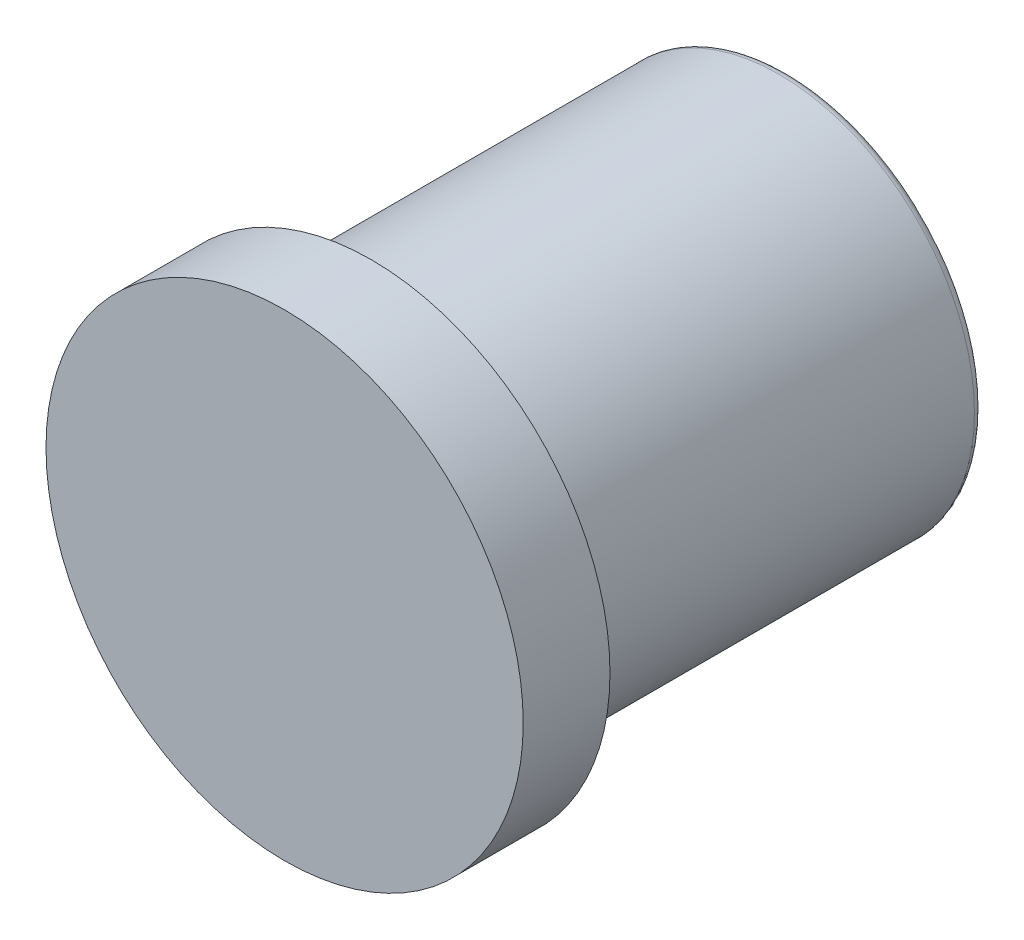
from build123d import *

# Parameters (mm, degrees)
M8_TAPPED_HOLE1_D           = 6.8
M8_TAPPED_HOLE1_DEPTH       = 11.75
M8_TAPPED_HOLE1_CSINK_D     = 8.05
M8_TAPPED_HOLE1_CSINK_ANGLE = 90
M8_TAPPED_HOLE1_TIP         = 2.042926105


with BuildPart() as part:
    # Sketch1 → Revolve1 (revolve)
    with BuildSketch(Plane(origin=(0, 0, 0), x_dir=(0, 0, -1), z_dir=(1, 0, 0)), mode=Mode.PRIVATE) as revolve1_sk:
        with BuildLine():
            Line((58, 0), (58, 21.5))
            ThreePointArc((58, 21.5), (57.707106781, 22.207106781), (57, 22.5))
            Line((57, 22.5), (10, 22.5))
            Line((10, 22.5), (10, 27.5))
            Line((10, 27.5), (0, 27.5))
            Line((0, 27.5), (0, 0))
            Line((0, 0), (58, 0))
        make_face()
    revolve(revolve1_sk.sketch.rotate(Axis((0, 0, 0), (0, 0, -1)), 90), axis=Axis((0, 0, 0), (0, 0, -1)))

    # M8 Tapped Hole1
    with Locations(Plane(origin=(0, 0, -58), x_dir=(-1, 0, 0), z_dir=(0, 0, -1))):
        with Locations((0, 0)):
            CounterSinkHole(M8_TAPPED_HOLE1_D / 2, M8_TAPPED_HOLE1_CSINK_D / 2, depth=M8_TAPPED_HOLE1_DEPTH, counter_sink_angle=M8_TAPPED_HOLE1_CSINK_ANGLE)
            with Locations((0, 0, -(M8_TAPPED_HOLE1_DEPTH + M8_TAPPED_HOLE1_TIP / 2))):  # 118° drill point
                Cone(0, M8_TAPPED_HOLE1_D / 2, M8_TAPPED_HOLE1_TIP, mode=Mode.SUBTRACT)


solid = part.part
